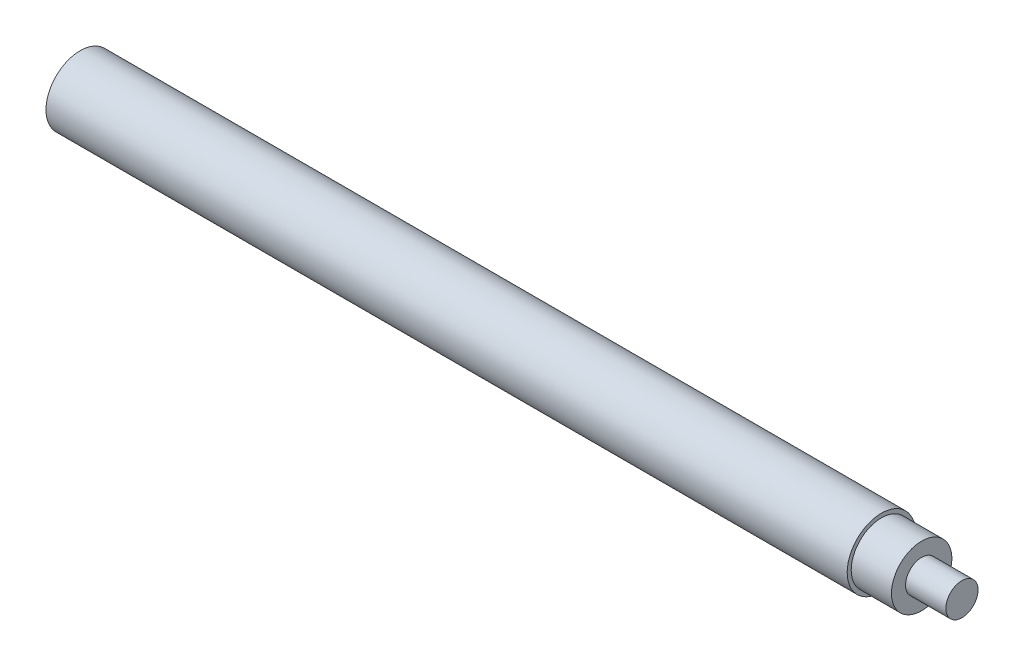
ISO-10303-21;
HEADER;
FILE_DESCRIPTION(('STEP AP214'),'2;1');
FILE_NAME('part.step','',(''),(''),'','','');
FILE_SCHEMA(('AUTOMOTIVE_DESIGN { 1 0 10303 214 1 1 1 1 }'));
ENDSEC;
DATA;
#1=APPLICATION_CONTEXT('core data for automotive mechanical design processes');
#2=APPLICATION_PROTOCOL_DEFINITION('international standard','automotive_design',2000,#1);
#3=PRODUCT_CONTEXT('',#1,'mechanical');
#4=PRODUCT('Part','Part','',(#3));
#5=PRODUCT_RELATED_PRODUCT_CATEGORY('part','',(#4));
#6=PRODUCT_DEFINITION_FORMATION('','',#4);
#7=PRODUCT_DEFINITION_CONTEXT('part definition',#1,'design');
#8=PRODUCT_DEFINITION('design','',#6,#7);
#9=PRODUCT_DEFINITION_SHAPE('','',#8);
#10=(LENGTH_UNIT() NAMED_UNIT(*) SI_UNIT(.MILLI.,.METRE.));
#11=(NAMED_UNIT(*) PLANE_ANGLE_UNIT() SI_UNIT($,.RADIAN.));
#12=(NAMED_UNIT(*) SI_UNIT($,.STERADIAN.) SOLID_ANGLE_UNIT());
#13=UNCERTAINTY_MEASURE_WITH_UNIT(LENGTH_MEASURE(1.E-05),#10,'distance_accuracy_value','');
#14=(GEOMETRIC_REPRESENTATION_CONTEXT(3) GLOBAL_UNCERTAINTY_ASSIGNED_CONTEXT((#13)) GLOBAL_UNIT_ASSIGNED_CONTEXT((#10,
#11,#12)) REPRESENTATION_CONTEXT('',''));
#15=CARTESIAN_POINT('',(0.,0.,0.));
#16=DIRECTION('',(0.,0.,1.));
#17=DIRECTION('',(1.,0.,0.));
#18=AXIS2_PLACEMENT_3D('',#15,#16,#17);
#19=CARTESIAN_POINT('',(0.,8.5,0.));
#20=DIRECTION('',(1.,0.,0.));
#21=DIRECTION('',(0.,0.,-1.));
#22=AXIS2_PLACEMENT_3D('',#19,#20,#21);
#23=PLANE('',#22);
#24=CARTESIAN_POINT('',(0.,0.,0.));
#25=DIRECTION('',(-1.,0.,0.));
#26=DIRECTION('',(0.,0.,1.));
#27=AXIS2_PLACEMENT_3D('',#24,#25,#26);
#28=CIRCLE('',#27,2.45);
#29=CARTESIAN_POINT('',(0.,0.,2.45));
#30=VERTEX_POINT('',#29);
#31=EDGE_CURVE('E54',#30,#30,#28,.T.);
#32=ORIENTED_EDGE('',*,*,#31,.F.);
#33=EDGE_LOOP('',(#32));
#34=FACE_BOUND('',#33,.T.);
#35=CARTESIAN_POINT('',(0.,0.,0.));
#36=DIRECTION('',(-1.,0.,0.));
#37=DIRECTION('',(0.,0.,1.));
#38=AXIS2_PLACEMENT_3D('',#35,#36,#37);
#39=CIRCLE('',#38,8.5);
#40=CARTESIAN_POINT('',(0.,0.,8.5));
#41=VERTEX_POINT('',#40);
#42=EDGE_CURVE('E50',#41,#41,#39,.T.);
#43=ORIENTED_EDGE('',*,*,#42,.T.);
#44=EDGE_LOOP('',(#43));
#45=FACE_BOUND('',#44,.T.);
#46=ADVANCED_FACE('F28',(#34,#45),#23,.F.);
#47=CARTESIAN_POINT('',(219.,0.,0.));
#48=DIRECTION('',(-1.,0.,0.));
#49=DIRECTION('',(0.,0.,1.));
#50=AXIS2_PLACEMENT_3D('',#47,#48,#49);
#51=PLANE('',#50);
#52=CARTESIAN_POINT('',(219.,0.,0.));
#53=DIRECTION('',(-1.,0.,0.));
#54=DIRECTION('',(0.,0.,1.));
#55=AXIS2_PLACEMENT_3D('',#52,#53,#54);
#56=CIRCLE('',#55,4.);
#57=CARTESIAN_POINT('',(219.,0.,4.));
#58=VERTEX_POINT('',#57);
#59=EDGE_CURVE('E10',#58,#58,#56,.T.);
#60=ORIENTED_EDGE('',*,*,#59,.F.);
#61=EDGE_LOOP('',(#60));
#62=FACE_BOUND('',#61,.T.);
#63=ADVANCED_FACE('F71',(#62),#51,.F.);
#64=CARTESIAN_POINT('',(0.,0.,0.));
#65=DIRECTION('',(-1.,0.,0.));
#66=DIRECTION('',(0.,0.,1.));
#67=AXIS2_PLACEMENT_3D('',#64,#65,#66);
#68=CYLINDRICAL_SURFACE('',#67,4.);
#69=CARTESIAN_POINT('',(209.,0.,0.));
#70=DIRECTION('',(-1.,0.,0.));
#71=DIRECTION('',(0.,0.,1.));
#72=AXIS2_PLACEMENT_3D('',#69,#70,#71);
#73=CIRCLE('',#72,4.);
#74=CARTESIAN_POINT('',(209.,0.,4.));
#75=VERTEX_POINT('',#74);
#76=EDGE_CURVE('E34',#75,#75,#73,.T.);
#77=ORIENTED_EDGE('',*,*,#76,.F.);
#78=EDGE_LOOP('',(#77));
#79=FACE_BOUND('',#78,.T.);
#80=ORIENTED_EDGE('',*,*,#59,.T.);
#81=EDGE_LOOP('',(#80));
#82=FACE_BOUND('',#81,.T.);
#83=ADVANCED_FACE('F93',(#79,#82),#68,.T.);
#84=CARTESIAN_POINT('',(209.,4.,0.));
#85=DIRECTION('',(-1.,0.,0.));
#86=DIRECTION('',(0.,0.,1.));
#87=AXIS2_PLACEMENT_3D('',#84,#85,#86);
#88=PLANE('',#87);
#89=CARTESIAN_POINT('',(209.,0.,0.));
#90=DIRECTION('',(-1.,0.,0.));
#91=DIRECTION('',(0.,0.,1.));
#92=AXIS2_PLACEMENT_3D('',#89,#90,#91);
#93=CIRCLE('',#92,7.5);
#94=CARTESIAN_POINT('',(209.,0.,7.5));
#95=VERTEX_POINT('',#94);
#96=EDGE_CURVE('E38',#95,#95,#93,.T.);
#97=ORIENTED_EDGE('',*,*,#96,.F.);
#98=EDGE_LOOP('',(#97));
#99=FACE_BOUND('',#98,.T.);
#100=ORIENTED_EDGE('',*,*,#76,.T.);
#101=EDGE_LOOP('',(#100));
#102=FACE_BOUND('',#101,.T.);
#103=ADVANCED_FACE('F88',(#99,#102),#88,.F.);
#104=CARTESIAN_POINT('',(0.,0.,0.));
#105=DIRECTION('',(-1.,0.,0.));
#106=DIRECTION('',(0.,0.,1.));
#107=AXIS2_PLACEMENT_3D('',#104,#105,#106);
#108=CYLINDRICAL_SURFACE('',#107,7.5);
#109=CARTESIAN_POINT('',(199.,0.,0.));
#110=DIRECTION('',(-1.,0.,0.));
#111=DIRECTION('',(0.,0.,1.));
#112=AXIS2_PLACEMENT_3D('',#109,#110,#111);
#113=CIRCLE('',#112,7.5);
#114=CARTESIAN_POINT('',(199.,0.,7.5));
#115=VERTEX_POINT('',#114);
#116=EDGE_CURVE('E42',#115,#115,#113,.T.);
#117=ORIENTED_EDGE('',*,*,#116,.F.);
#118=EDGE_LOOP('',(#117));
#119=FACE_BOUND('',#118,.T.);
#120=ORIENTED_EDGE('',*,*,#96,.T.);
#121=EDGE_LOOP('',(#120));
#122=FACE_BOUND('',#121,.T.);
#123=ADVANCED_FACE('F82',(#119,#122),#108,.T.);
#124=CARTESIAN_POINT('',(199.,7.5,0.));
#125=DIRECTION('',(-1.,0.,0.));
#126=DIRECTION('',(0.,0.,1.));
#127=AXIS2_PLACEMENT_3D('',#124,#125,#126);
#128=PLANE('',#127);
#129=CARTESIAN_POINT('',(199.,0.,0.));
#130=DIRECTION('',(-1.,0.,0.));
#131=DIRECTION('',(0.,0.,1.));
#132=AXIS2_PLACEMENT_3D('',#129,#130,#131);
#133=CIRCLE('',#132,8.50000000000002);
#134=CARTESIAN_POINT('',(199.,0.,8.50000000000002));
#135=VERTEX_POINT('',#134);
#136=EDGE_CURVE('E47',#135,#135,#133,.T.);
#137=ORIENTED_EDGE('',*,*,#136,.F.);
#138=EDGE_LOOP('',(#137));
#139=FACE_BOUND('',#138,.T.);
#140=ORIENTED_EDGE('',*,*,#116,.T.);
#141=EDGE_LOOP('',(#140));
#142=FACE_BOUND('',#141,.T.);
#143=ADVANCED_FACE('F76',(#139,#142),#128,.F.);
#144=CARTESIAN_POINT('',(0.,0.,0.));
#145=DIRECTION('',(-1.,0.,0.));
#146=DIRECTION('',(0.,0.,1.));
#147=AXIS2_PLACEMENT_3D('',#144,#145,#146);
#148=CYLINDRICAL_SURFACE('',#147,8.50000000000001);
#149=ORIENTED_EDGE('',*,*,#42,.F.);
#150=EDGE_LOOP('',(#149));
#151=FACE_BOUND('',#150,.T.);
#152=ORIENTED_EDGE('',*,*,#136,.T.);
#153=EDGE_LOOP('',(#152));
#154=FACE_BOUND('',#153,.T.);
#155=ADVANCED_FACE('F65',(#151,#154),#148,.T.);
#156=CARTESIAN_POINT('',(10.,0.,0.));
#157=DIRECTION('',(-1.,0.,0.));
#158=DIRECTION('',(0.,0.,1.));
#159=AXIS2_PLACEMENT_3D('',#156,#157,#158);
#160=CYLINDRICAL_SURFACE('',#159,2.45);
#161=CARTESIAN_POINT('',(10.,0.,0.));
#162=DIRECTION('',(-1.,0.,0.));
#163=DIRECTION('',(0.,0.,1.));
#164=AXIS2_PLACEMENT_3D('',#161,#162,#163);
#165=CIRCLE('',#164,2.45);
#166=CARTESIAN_POINT('',(10.,0.,2.45));
#167=VERTEX_POINT('',#166);
#168=EDGE_CURVE('E53',#167,#167,#165,.T.);
#169=ORIENTED_EDGE('',*,*,#168,.F.);
#170=EDGE_LOOP('',(#169));
#171=FACE_BOUND('',#170,.T.);
#172=ORIENTED_EDGE('',*,*,#31,.T.);
#173=EDGE_LOOP('',(#172));
#174=FACE_BOUND('',#173,.T.);
#175=ADVANCED_FACE('F62',(#171,#174),#160,.F.);
#176=CARTESIAN_POINT('',(10.,0.,0.));
#177=DIRECTION('',(-1.,0.,0.));
#178=DIRECTION('',(0.,0.,1.));
#179=AXIS2_PLACEMENT_3D('',#176,#177,#178);
#180=PLANE('',#179);
#181=ORIENTED_EDGE('',*,*,#168,.T.);
#182=EDGE_LOOP('',(#181));
#183=FACE_BOUND('',#182,.T.);
#184=ADVANCED_FACE('F60',(#183),#180,.T.);
#185=CLOSED_SHELL('',(#46,#63,#83,#103,#123,#143,#155,#175,#184));
#186=MANIFOLD_SOLID_BREP('B2',#185);
#187=ADVANCED_BREP_SHAPE_REPRESENTATION('',(#18,#186),#14);
#188=SHAPE_DEFINITION_REPRESENTATION(#9,#187);
ENDSEC;
END-ISO-10303-21;
